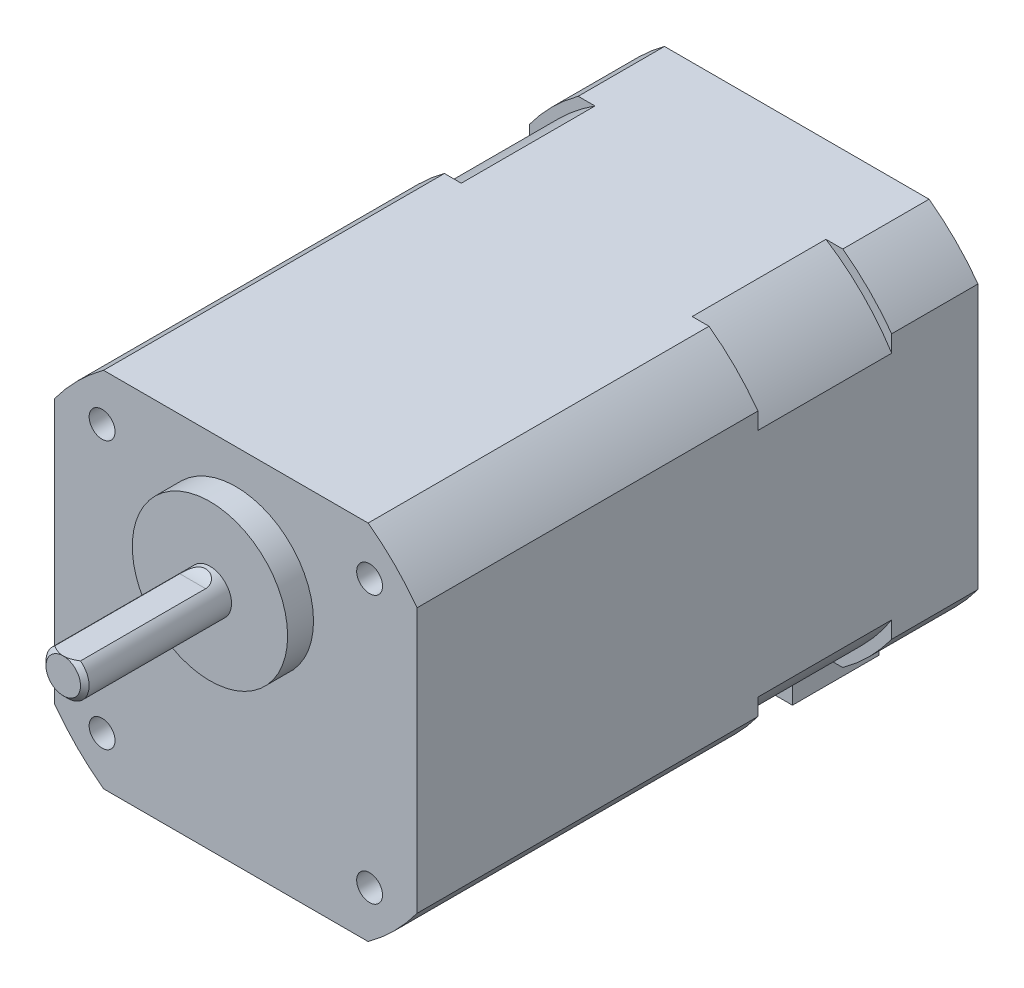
ISO-10303-21;
HEADER;
FILE_DESCRIPTION(('STEP AP214'),'2;1');
FILE_NAME('part.step','',(''),(''),'','','');
FILE_SCHEMA(('AUTOMOTIVE_DESIGN { 1 0 10303 214 1 1 1 1 }'));
ENDSEC;
DATA;
#1=APPLICATION_CONTEXT('core data for automotive mechanical design processes');
#2=APPLICATION_PROTOCOL_DEFINITION('international standard','automotive_design',2000,#1);
#3=PRODUCT_CONTEXT('',#1,'mechanical');
#4=PRODUCT('Part','Part','',(#3));
#5=PRODUCT_RELATED_PRODUCT_CATEGORY('part','',(#4));
#6=PRODUCT_DEFINITION_FORMATION('','',#4);
#7=PRODUCT_DEFINITION_CONTEXT('part definition',#1,'design');
#8=PRODUCT_DEFINITION('design','',#6,#7);
#9=PRODUCT_DEFINITION_SHAPE('','',#8);
#10=(LENGTH_UNIT() NAMED_UNIT(*) SI_UNIT(.MILLI.,.METRE.));
#11=(NAMED_UNIT(*) PLANE_ANGLE_UNIT() SI_UNIT($,.RADIAN.));
#12=(NAMED_UNIT(*) SI_UNIT($,.STERADIAN.) SOLID_ANGLE_UNIT());
#13=UNCERTAINTY_MEASURE_WITH_UNIT(LENGTH_MEASURE(1.E-05),#10,'distance_accuracy_value','');
#14=(GEOMETRIC_REPRESENTATION_CONTEXT(3) GLOBAL_UNCERTAINTY_ASSIGNED_CONTEXT((#13)) GLOBAL_UNIT_ASSIGNED_CONTEXT((#10,
#11,#12)) REPRESENTATION_CONTEXT('',''));
#15=CARTESIAN_POINT('',(0.,0.,0.));
#16=DIRECTION('',(0.,0.,1.));
#17=DIRECTION('',(1.,0.,0.));
#18=AXIS2_PLACEMENT_3D('',#15,#16,#17);
#19=CARTESIAN_POINT('',(0.,-29.,-32.2));
#20=DIRECTION('',(0.,1.,0.));
#21=DIRECTION('',(0.,0.,1.));
#22=AXIS2_PLACEMENT_3D('',#19,#20,#21);
#23=PLANE('',#22);
#24=DIRECTION('',(0.,0.,-1.));
#25=VECTOR('',#24,1.);
#26=CARTESIAN_POINT('',(-9.5,-29.,-65.));
#27=LINE('',#26,#25);
#28=CARTESIAN_POINT('',(-9.5,-29.,-55.));
#29=VERTEX_POINT('',#28);
#30=CARTESIAN_POINT('',(-9.5,-29.,-65.));
#31=VERTEX_POINT('',#30);
#32=EDGE_CURVE('E55',#29,#31,#27,.T.);
#33=ORIENTED_EDGE('',*,*,#32,.F.);
#34=DIRECTION('',(-1.,0.,0.));
#35=VECTOR('',#34,1.);
#36=CARTESIAN_POINT('',(-9.5,-29.,-55.));
#37=LINE('',#36,#35);
#38=CARTESIAN_POINT('',(9.5,-29.,-55.));
#39=VERTEX_POINT('',#38);
#40=EDGE_CURVE('E257',#39,#29,#37,.T.);
#41=ORIENTED_EDGE('',*,*,#40,.F.);
#42=DIRECTION('',(0.,0.,1.));
#43=VECTOR('',#42,1.);
#44=CARTESIAN_POINT('',(9.5,-29.,-65.));
#45=LINE('',#44,#43);
#46=CARTESIAN_POINT('',(9.5,-29.,-65.));
#47=VERTEX_POINT('',#46);
#48=EDGE_CURVE('E1106',#47,#39,#45,.T.);
#49=ORIENTED_EDGE('',*,*,#48,.F.);
#50=DIRECTION('',(-1.,0.,0.));
#51=VECTOR('',#50,1.);
#52=CARTESIAN_POINT('',(0.,-29.,-65.));
#53=LINE('',#52,#51);
#54=CARTESIAN_POINT('',(15.3297097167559,-29.,-65.));
#55=VERTEX_POINT('',#54);
#56=EDGE_CURVE('E268',#55,#47,#53,.T.);
#57=ORIENTED_EDGE('',*,*,#56,.F.);
#58=DIRECTION('',(0.,0.,1.));
#59=VECTOR('',#58,1.);
#60=CARTESIAN_POINT('',(15.3297097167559,-29.,-65.));
#61=LINE('',#60,#59);
#62=CARTESIAN_POINT('',(15.3297097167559,-29.,-55.));
#63=VERTEX_POINT('',#62);
#64=EDGE_CURVE('E283',#55,#63,#61,.T.);
#65=ORIENTED_EDGE('',*,*,#64,.T.);
#66=DIRECTION('',(-1.,0.,0.));
#67=VECTOR('',#66,1.);
#68=CARTESIAN_POINT('',(0.,-29.,-55.));
#69=LINE('',#68,#67);
#70=CARTESIAN_POINT('',(13.3794618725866,-29.,-55.));
#71=VERTEX_POINT('',#70);
#72=EDGE_CURVE('E262',#63,#71,#69,.T.);
#73=ORIENTED_EDGE('',*,*,#72,.T.);
#74=DIRECTION('',(0.,0.,1.));
#75=VECTOR('',#74,1.);
#76=CARTESIAN_POINT('',(13.3794618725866,-29.,-55.));
#77=LINE('',#76,#75);
#78=CARTESIAN_POINT('',(13.3794618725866,-29.,-39.5));
#79=VERTEX_POINT('',#78);
#80=EDGE_CURVE('E345',#71,#79,#77,.T.);
#81=ORIENTED_EDGE('',*,*,#80,.T.);
#82=DIRECTION('',(-1.,0.,0.));
#83=VECTOR('',#82,1.);
#84=CARTESIAN_POINT('',(15.3297097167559,-29.,-39.5));
#85=LINE('',#84,#83);
#86=CARTESIAN_POINT('',(15.3297097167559,-29.,-39.5));
#87=VERTEX_POINT('',#86);
#88=EDGE_CURVE('E385',#87,#79,#85,.T.);
#89=ORIENTED_EDGE('',*,*,#88,.F.);
#90=DIRECTION('',(0.,0.,1.));
#91=VECTOR('',#90,1.);
#92=CARTESIAN_POINT('',(15.3297097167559,-29.,-32.2));
#93=LINE('',#92,#91);
#94=CARTESIAN_POINT('',(15.3297097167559,-29.,0.));
#95=VERTEX_POINT('',#94);
#96=EDGE_CURVE('E410',#87,#95,#93,.T.);
#97=ORIENTED_EDGE('',*,*,#96,.T.);
#98=DIRECTION('',(-1.,0.,0.));
#99=VECTOR('',#98,1.);
#100=CARTESIAN_POINT('',(0.,-29.,0.));
#101=LINE('',#100,#99);
#102=CARTESIAN_POINT('',(-15.3297097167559,-29.,0.));
#103=VERTEX_POINT('',#102);
#104=EDGE_CURVE('E402',#95,#103,#101,.T.);
#105=ORIENTED_EDGE('',*,*,#104,.T.);
#106=DIRECTION('',(0.,0.,1.));
#107=VECTOR('',#106,1.);
#108=CARTESIAN_POINT('',(-15.3297097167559,-29.,-32.2));
#109=LINE('',#108,#107);
#110=CARTESIAN_POINT('',(-15.3297097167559,-29.,-39.5));
#111=VERTEX_POINT('',#110);
#112=EDGE_CURVE('E407',#111,#103,#109,.T.);
#113=ORIENTED_EDGE('',*,*,#112,.F.);
#114=CARTESIAN_POINT('',(-13.3794618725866,-29.,-39.5));
#115=VERTEX_POINT('',#114);
#116=EDGE_CURVE('E384',#115,#111,#85,.T.);
#117=ORIENTED_EDGE('',*,*,#116,.F.);
#118=DIRECTION('',(0.,0.,1.));
#119=VECTOR('',#118,1.);
#120=CARTESIAN_POINT('',(-13.3794618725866,-29.,-55.));
#121=LINE('',#120,#119);
#122=CARTESIAN_POINT('',(-13.3794618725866,-29.,-55.));
#123=VERTEX_POINT('',#122);
#124=EDGE_CURVE('E342',#123,#115,#121,.T.);
#125=ORIENTED_EDGE('',*,*,#124,.F.);
#126=CARTESIAN_POINT('',(-15.3297097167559,-29.,-55.));
#127=VERTEX_POINT('',#126);
#128=EDGE_CURVE('E260',#123,#127,#69,.T.);
#129=ORIENTED_EDGE('',*,*,#128,.T.);
#130=DIRECTION('',(0.,0.,1.));
#131=VECTOR('',#130,1.);
#132=CARTESIAN_POINT('',(-15.3297097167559,-29.,-65.));
#133=LINE('',#132,#131);
#134=CARTESIAN_POINT('',(-15.3297097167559,-29.,-65.));
#135=VERTEX_POINT('',#134);
#136=EDGE_CURVE('E326',#135,#127,#133,.T.);
#137=ORIENTED_EDGE('',*,*,#136,.F.);
#138=EDGE_CURVE('E60',#31,#135,#53,.T.);
#139=ORIENTED_EDGE('',*,*,#138,.F.);
#140=EDGE_LOOP('',(#33,#41,#49,#57,#65,#73,#81,#89,#97,#105,#113,#117,#125,#129,#137,#139));
#141=FACE_BOUND('',#140,.T.);
#142=ADVANCED_FACE('F39',(#141),#23,.F.);
#143=CARTESIAN_POINT('',(0.,-8.,-39.5));
#144=DIRECTION('',(0.,0.,-1.));
#145=DIRECTION('',(-1.,0.,0.));
#146=AXIS2_PLACEMENT_3D('',#143,#144,#145);
#147=PLANE('',#146);
#148=CARTESIAN_POINT('',(0.,-8.,-39.5));
#149=DIRECTION('',(0.,0.,-1.));
#150=DIRECTION('',(-1.,0.,0.));
#151=AXIS2_PLACEMENT_3D('',#148,#149,#150);
#152=CIRCLE('',#151,24.9);
#153=CARTESIAN_POINT('',(-21.,-21.3794618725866,-39.5));
#154=VERTEX_POINT('',#153);
#155=EDGE_CURVE('E334',#115,#154,#152,.T.);
#156=ORIENTED_EDGE('',*,*,#155,.F.);
#157=ORIENTED_EDGE('',*,*,#116,.T.);
#158=CARTESIAN_POINT('',(0.,-8.,-39.5));
#159=DIRECTION('',(0.,0.,-1.));
#160=DIRECTION('',(-1.,0.,0.));
#161=AXIS2_PLACEMENT_3D('',#158,#159,#160);
#162=CIRCLE('',#161,26.);
#163=CARTESIAN_POINT('',(-21.,-23.3297097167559,-39.5));
#164=VERTEX_POINT('',#163);
#165=EDGE_CURVE('E363',#111,#164,#162,.T.);
#166=ORIENTED_EDGE('',*,*,#165,.T.);
#167=DIRECTION('',(0.,1.,0.));
#168=VECTOR('',#167,1.);
#169=CARTESIAN_POINT('',(-21.,-23.3297097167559,-39.5));
#170=LINE('',#169,#168);
#171=EDGE_CURVE('E367',#164,#154,#170,.T.);
#172=ORIENTED_EDGE('',*,*,#171,.T.);
#173=EDGE_LOOP('',(#156,#157,#166,#172));
#174=FACE_BOUND('',#173,.T.);
#175=ADVANCED_FACE('F604',(#174),#147,.T.);
#176=CARTESIAN_POINT('',(21.,-21.3794618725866,-39.5));
#177=VERTEX_POINT('',#176);
#178=EDGE_CURVE('E546',#177,#79,#152,.T.);
#179=ORIENTED_EDGE('',*,*,#178,.F.);
#180=DIRECTION('',(0.,-1.,0.));
#181=VECTOR('',#180,1.);
#182=CARTESIAN_POINT('',(21.,7.3297097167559,-39.5));
#183=LINE('',#182,#181);
#184=CARTESIAN_POINT('',(21.,-23.3297097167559,-39.5));
#185=VERTEX_POINT('',#184);
#186=EDGE_CURVE('E378',#177,#185,#183,.T.);
#187=ORIENTED_EDGE('',*,*,#186,.T.);
#188=CARTESIAN_POINT('',(0.,-8.,-39.5));
#189=DIRECTION('',(0.,0.,-1.));
#190=DIRECTION('',(-1.,0.,0.));
#191=AXIS2_PLACEMENT_3D('',#188,#189,#190);
#192=CIRCLE('',#191,26.);
#193=EDGE_CURVE('E381',#185,#87,#192,.T.);
#194=ORIENTED_EDGE('',*,*,#193,.T.);
#195=ORIENTED_EDGE('',*,*,#88,.T.);
#196=EDGE_LOOP('',(#179,#187,#194,#195));
#197=FACE_BOUND('',#196,.T.);
#198=ADVANCED_FACE('F606',(#197),#147,.T.);
#199=CARTESIAN_POINT('',(13.3794618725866,13.,-39.5));
#200=VERTEX_POINT('',#199);
#201=CARTESIAN_POINT('',(21.,5.37946187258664,-39.5));
#202=VERTEX_POINT('',#201);
#203=EDGE_CURVE('E338',#200,#202,#152,.T.);
#204=ORIENTED_EDGE('',*,*,#203,.F.);
#205=DIRECTION('',(1.,0.,0.));
#206=VECTOR('',#205,1.);
#207=CARTESIAN_POINT('',(-15.3297097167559,13.,-39.5));
#208=LINE('',#207,#206);
#209=CARTESIAN_POINT('',(15.3297097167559,13.,-39.5));
#210=VERTEX_POINT('',#209);
#211=EDGE_CURVE('E372',#200,#210,#208,.T.);
#212=ORIENTED_EDGE('',*,*,#211,.T.);
#213=CARTESIAN_POINT('',(0.,-8.,-39.5));
#214=DIRECTION('',(0.,0.,-1.));
#215=DIRECTION('',(-1.,0.,0.));
#216=AXIS2_PLACEMENT_3D('',#213,#214,#215);
#217=CIRCLE('',#216,26.);
#218=CARTESIAN_POINT('',(21.,7.3297097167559,-39.5));
#219=VERTEX_POINT('',#218);
#220=EDGE_CURVE('E375',#210,#219,#217,.T.);
#221=ORIENTED_EDGE('',*,*,#220,.T.);
#222=EDGE_CURVE('E379',#219,#202,#183,.T.);
#223=ORIENTED_EDGE('',*,*,#222,.T.);
#224=EDGE_LOOP('',(#204,#212,#221,#223));
#225=FACE_BOUND('',#224,.T.);
#226=ADVANCED_FACE('F502',(#225),#147,.T.);
#227=CARTESIAN_POINT('',(0.,0.,3.));
#228=DIRECTION('',(0.,0.,-1.));
#229=DIRECTION('',(-1.,0.,0.));
#230=AXIS2_PLACEMENT_3D('',#227,#228,#229);
#231=CYLINDRICAL_SURFACE('',#230,9.);
#232=CARTESIAN_POINT('',(0.,0.,3.));
#233=DIRECTION('',(0.,0.,1.));
#234=DIRECTION('',(1.,0.,0.));
#235=AXIS2_PLACEMENT_3D('',#232,#233,#234);
#236=CIRCLE('',#235,9.);
#237=CARTESIAN_POINT('',(9.,0.,3.));
#238=VERTEX_POINT('',#237);
#239=EDGE_CURVE('E433',#238,#238,#236,.T.);
#240=ORIENTED_EDGE('',*,*,#239,.F.);
#241=EDGE_LOOP('',(#240));
#242=FACE_BOUND('',#241,.T.);
#243=CARTESIAN_POINT('',(0.,0.,0.));
#244=DIRECTION('',(0.,0.,1.));
#245=DIRECTION('',(1.,0.,0.));
#246=AXIS2_PLACEMENT_3D('',#243,#244,#245);
#247=CIRCLE('',#246,9.);
#248=CARTESIAN_POINT('',(9.,0.,0.));
#249=VERTEX_POINT('',#248);
#250=EDGE_CURVE('E424',#249,#249,#247,.T.);
#251=ORIENTED_EDGE('',*,*,#250,.T.);
#252=EDGE_LOOP('',(#251));
#253=FACE_BOUND('',#252,.T.);
#254=ADVANCED_FACE('F497',(#242,#253),#231,.T.);
#255=CARTESIAN_POINT('',(0.,0.,3.));
#256=DIRECTION('',(0.,0.,1.));
#257=DIRECTION('',(1.,0.,0.));
#258=AXIS2_PLACEMENT_3D('',#255,#256,#257);
#259=PLANE('',#258);
#260=CARTESIAN_POINT('',(0.,0.,3.));
#261=DIRECTION('',(0.,0.,1.));
#262=DIRECTION('',(1.,0.,0.));
#263=AXIS2_PLACEMENT_3D('',#260,#261,#262);
#264=CIRCLE('',#263,2.5);
#265=CARTESIAN_POINT('',(2.5,0.,3.));
#266=VERTEX_POINT('',#265);
#267=EDGE_CURVE('E434',#266,#266,#264,.T.);
#268=ORIENTED_EDGE('',*,*,#267,.F.);
#269=EDGE_LOOP('',(#268));
#270=FACE_BOUND('',#269,.T.);
#271=ORIENTED_EDGE('',*,*,#239,.T.);
#272=EDGE_LOOP('',(#271));
#273=FACE_BOUND('',#272,.T.);
#274=ADVANCED_FACE('F492',(#270,#273),#259,.T.);
#275=CARTESIAN_POINT('',(0.,0.,20.));
#276=DIRECTION('',(0.,0.,-1.));
#277=DIRECTION('',(-1.,0.,0.));
#278=AXIS2_PLACEMENT_3D('',#275,#276,#277);
#279=CYLINDRICAL_SURFACE('',#278,2.5);
#280=DIRECTION('',(0.,0.,-1.));
#281=VECTOR('',#280,1.);
#282=CARTESIAN_POINT('',(1.5,2.,20.));
#283=LINE('',#282,#281);
#284=CARTESIAN_POINT('',(1.5,2.,5.));
#285=VERTEX_POINT('',#284);
#286=CARTESIAN_POINT('',(1.5,2.,19.5));
#287=VERTEX_POINT('',#286);
#288=EDGE_CURVE('E428',#285,#287,#283,.F.);
#289=ORIENTED_EDGE('',*,*,#288,.T.);
#290=CARTESIAN_POINT('',(0.,0.,19.5));
#291=DIRECTION('',(0.,0.,1.));
#292=DIRECTION('',(1.,0.,0.));
#293=AXIS2_PLACEMENT_3D('',#290,#291,#292);
#294=CIRCLE('',#293,2.5);
#295=CARTESIAN_POINT('',(-1.5,2.,19.5));
#296=VERTEX_POINT('',#295);
#297=EDGE_CURVE('E11',#287,#296,#294,.F.);
#298=ORIENTED_EDGE('',*,*,#297,.T.);
#299=DIRECTION('',(0.,0.,-1.));
#300=VECTOR('',#299,1.);
#301=CARTESIAN_POINT('',(-1.5,2.,20.));
#302=LINE('',#301,#300);
#303=CARTESIAN_POINT('',(-1.5,2.,5.));
#304=VERTEX_POINT('',#303);
#305=EDGE_CURVE('E431',#296,#304,#302,.T.);
#306=ORIENTED_EDGE('',*,*,#305,.T.);
#307=CARTESIAN_POINT('',(-1.5,2.,5.));
#308=CARTESIAN_POINT('',(-1.49999715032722,1.99999314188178,4.95892674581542));
#309=CARTESIAN_POINT('',(-1.49865021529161,2.0010120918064,4.91785429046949));
#310=CARTESIAN_POINT('',(-1.4932483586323,2.00505117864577,4.83598328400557));
#311=CARTESIAN_POINT('',(-1.48919319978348,2.00807149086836,4.79518475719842));
#312=CARTESIAN_POINT('',(-1.47835056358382,2.01606618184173,4.71410748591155));
#313=CARTESIAN_POINT('',(-1.47156081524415,2.02104218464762,4.67382920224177));
#314=CARTESIAN_POINT('',(-1.45522246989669,2.03283738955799,4.59412385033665));
#315=CARTESIAN_POINT('',(-1.44567398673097,2.03965651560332,4.55469674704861));
#316=CARTESIAN_POINT('',(-1.41279633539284,2.06270144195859,4.43800575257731));
#317=CARTESIAN_POINT('',(-1.38523998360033,2.08151079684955,4.36237086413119));
#318=CARTESIAN_POINT('',(-1.31873332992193,2.12426241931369,4.21798498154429));
#319=CARTESIAN_POINT('',(-1.2797940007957,2.14819973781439,4.14922744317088));
#320=CARTESIAN_POINT('',(-1.19150122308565,2.19837375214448,4.02166810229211));
#321=CARTESIAN_POINT('',(-1.14234473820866,2.2245621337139,3.96271134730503));
#322=CARTESIAN_POINT('',(-1.0340484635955,2.27691680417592,3.85478819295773));
#323=CARTESIAN_POINT('',(-0.974907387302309,2.30308308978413,3.80582308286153));
#324=CARTESIAN_POINT('',(-0.849770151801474,2.35208125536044,3.71982766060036));
#325=CARTESIAN_POINT('',(-0.783987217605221,2.37498114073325,3.68252488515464));
#326=CARTESIAN_POINT('',(-0.646171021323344,2.41611971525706,3.61837007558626));
#327=CARTESIAN_POINT('',(-0.574136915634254,2.43435777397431,3.59151945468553));
#328=CARTESIAN_POINT('',(-0.424128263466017,2.46497580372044,3.54761782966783));
#329=CARTESIAN_POINT('',(-0.346056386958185,2.47721439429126,3.5308014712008));
#330=CARTESIAN_POINT('',(-0.187572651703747,2.49422805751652,3.50765769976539));
#331=CARTESIAN_POINT('',(-0.107160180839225,2.49900115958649,3.50133305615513));
#332=CARTESIAN_POINT('',(0.0569228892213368,2.50074733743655,3.49900227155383));
#333=CARTESIAN_POINT('',(0.140602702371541,2.4974215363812,3.50339152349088));
#334=CARTESIAN_POINT('',(0.305874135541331,2.48260441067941,3.5234269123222));
#335=CARTESIAN_POINT('',(0.387465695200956,2.47111285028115,3.539073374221));
#336=CARTESIAN_POINT('',(0.546475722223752,2.44088811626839,3.58199212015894));
#337=CARTESIAN_POINT('',(0.623877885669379,2.42212868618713,3.60930659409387));
#338=CARTESIAN_POINT('',(0.771757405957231,2.37914220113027,3.67579490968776));
#339=CARTESIAN_POINT('',(0.842236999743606,2.35491692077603,3.71496490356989));
#340=CARTESIAN_POINT('',(0.971781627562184,2.3044115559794,3.8033874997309));
#341=CARTESIAN_POINT('',(1.03115970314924,2.27823299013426,3.8522394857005));
#342=CARTESIAN_POINT('',(1.13991312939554,2.2258143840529,3.95997396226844));
#343=CARTESIAN_POINT('',(1.18929246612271,2.1995743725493,4.01885243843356));
#344=CARTESIAN_POINT('',(1.2760399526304,2.15038394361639,4.14345454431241));
#345=CARTESIAN_POINT('',(1.31369451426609,2.12736421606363,4.20895245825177));
#346=CARTESIAN_POINT('',(1.37859452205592,2.08589814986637,4.34635283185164));
#347=CARTESIAN_POINT('',(1.4058302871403,2.06745607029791,4.41826117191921));
#348=CARTESIAN_POINT('',(1.43999574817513,2.0436789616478,4.5328616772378));
#349=CARTESIAN_POINT('',(1.45054113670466,2.03618591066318,4.57408272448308));
#350=CARTESIAN_POINT('',(1.46858445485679,2.023211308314,4.65751363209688));
#351=CARTESIAN_POINT('',(1.4760819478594,2.01773004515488,4.6997236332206));
#352=CARTESIAN_POINT('',(1.48806028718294,2.00891381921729,4.7847875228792));
#353=CARTESIAN_POINT('',(1.49254110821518,2.00557887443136,4.82764141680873));
#354=CARTESIAN_POINT('',(1.49850899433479,2.00111793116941,4.91366338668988));
#355=CARTESIAN_POINT('',(1.4999966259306,1.99999151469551,4.95683140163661));
#356=CARTESIAN_POINT('',(1.50000000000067,1.99999999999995,4.99999999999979));
#357=B_SPLINE_CURVE_WITH_KNOTS('',3,(#307,#308,#309,#310,#311,#312,#313,#314,#315,#316,#317,
#318,#319,#320,#321,#322,#323,#324,#325,#326,#327,#328,#329,#330,#331,#332,#333,#334,#335,#336,
#337,#338,#339,#340,#341,#342,#343,#344,#345,#346,#347,#348,#349,#350,#351,#352,#353,#354,#355,
#356),.UNSPECIFIED.,.F.,.F.,(4,2,2,2,2,2,2,2,2,2,2,2,2,2,2,2,2,2,2,2,2,2,2,2,4),(0.,
0.123183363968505,0.246377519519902,0.369674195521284,0.492965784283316,0.739665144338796,
0.986127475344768,1.22821834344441,1.47034042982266,1.70628928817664,1.94227003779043,
2.18357238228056,2.42493841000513,2.67534571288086,2.92576024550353,3.17708801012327,
3.42833429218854,3.67079201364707,3.91315288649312,4.14901905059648,4.38510385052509,
4.5145729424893,4.64406057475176,4.77354929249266,4.9030135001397),.UNSPECIFIED.);
#358=EDGE_CURVE('E437',#304,#285,#357,.T.);
#359=ORIENTED_EDGE('',*,*,#358,.T.);
#360=EDGE_LOOP('',(#289,#298,#306,#359));
#361=FACE_BOUND('',#360,.T.);
#362=ORIENTED_EDGE('',*,*,#267,.T.);
#363=EDGE_LOOP('',(#362));
#364=FACE_BOUND('',#363,.T.);
#365=ADVANCED_FACE('F452',(#361,#364),#279,.T.);
#366=CARTESIAN_POINT('',(0.,0.,20.));
#367=DIRECTION('',(0.,0.,1.));
#368=DIRECTION('',(1.,0.,0.));
#369=AXIS2_PLACEMENT_3D('',#366,#367,#368);
#370=PLANE('',#369);
#371=CARTESIAN_POINT('',(0.,0.,20.));
#372=DIRECTION('',(0.,0.,1.));
#373=DIRECTION('',(1.,0.,0.));
#374=AXIS2_PLACEMENT_3D('',#371,#372,#373);
#375=CIRCLE('',#374,1.99999999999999);
#376=CARTESIAN_POINT('',(0.,2.,20.));
#377=VERTEX_POINT('',#376);
#378=EDGE_CURVE('E450',#377,#377,#375,.T.);
#379=ORIENTED_EDGE('',*,*,#378,.T.);
#380=EDGE_LOOP('',(#379));
#381=FACE_BOUND('',#380,.T.);
#382=ADVANCED_FACE('F462',(#381),#370,.T.);
#383=CARTESIAN_POINT('',(-2.5,4.5,5.));
#384=DIRECTION('',(1.,0.,0.));
#385=DIRECTION('',(0.,0.,-1.));
#386=AXIS2_PLACEMENT_3D('',#383,#384,#385);
#387=CYLINDRICAL_SURFACE('',#386,2.5);
#388=DIRECTION('',(1.,0.,0.));
#389=VECTOR('',#388,1.);
#390=CARTESIAN_POINT('',(-2.5,2.,5.));
#391=LINE('',#390,#389);
#392=EDGE_CURVE('E425',#304,#285,#391,.T.);
#393=ORIENTED_EDGE('',*,*,#392,.T.);
#394=ORIENTED_EDGE('',*,*,#358,.F.);
#395=EDGE_LOOP('',(#393,#394));
#396=FACE_BOUND('',#395,.T.);
#397=ADVANCED_FACE('F456',(#396),#387,.F.);
#398=CARTESIAN_POINT('',(-2.5,2.,0.));
#399=DIRECTION('',(0.,-1.,0.));
#400=DIRECTION('',(0.,0.,-1.));
#401=AXIS2_PLACEMENT_3D('',#398,#399,#400);
#402=PLANE('',#401);
#403=CARTESIAN_POINT('',(-1.5,2.,19.5));
#404=CARTESIAN_POINT('',(-1.42763018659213,2.,19.5433736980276));
#405=CARTESIAN_POINT('',(-1.35436226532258,2.,19.5853687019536));
#406=CARTESIAN_POINT('',(-1.20549660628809,2.,19.6656443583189));
#407=CARTESIAN_POINT('',(-1.12989157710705,2.,19.7039114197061));
#408=CARTESIAN_POINT('',(-0.978296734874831,2.,19.774534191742));
#409=CARTESIAN_POINT('',(-0.902366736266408,2.,19.8070165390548));
#410=CARTESIAN_POINT('',(-0.748220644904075,2.,19.8658090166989));
#411=CARTESIAN_POINT('',(-0.670007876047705,2.,19.8921276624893));
#412=CARTESIAN_POINT('',(-0.543060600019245,2.,19.9280861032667));
#413=CARTESIAN_POINT('',(-0.495021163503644,2.,19.9401901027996));
#414=CARTESIAN_POINT('',(-0.398260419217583,2.,19.9612794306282));
#415=CARTESIAN_POINT('',(-0.349539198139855,2.,19.9702651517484));
#416=CARTESIAN_POINT('',(-0.250852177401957,2.,19.984927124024));
#417=CARTESIAN_POINT('',(-0.200878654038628,2.,19.9905520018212));
#418=CARTESIAN_POINT('',(-0.100607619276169,2.,19.9981023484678));
#419=CARTESIAN_POINT('',(-0.0503098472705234,2.,20.0000243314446));
#420=CARTESIAN_POINT('',(0.,2.,20.));
#421=B_SPLINE_CURVE_WITH_KNOTS('',3,(#403,#404,#405,#406,#407,#408,#409,#410,#411,#412,#413,
#414,#415,#416,#417,#418,#419,#420),.UNSPECIFIED.,.F.,.F.,(4,2,2,2,2,2,2,2,4),(0.,
0.253195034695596,0.507281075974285,0.754837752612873,1.00205037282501,1.15058504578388,
1.29910100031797,1.44983263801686,1.600706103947),.UNSPECIFIED.);
#422=EDGE_CURVE('E470',#296,#377,#421,.T.);
#423=ORIENTED_EDGE('',*,*,#422,.T.);
#424=CARTESIAN_POINT('',(0.,1.99999999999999,20.));
#425=CARTESIAN_POINT('',(0.0614966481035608,2.,20.0000514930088));
#426=CARTESIAN_POINT('',(0.122961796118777,2.,19.997164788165));
#427=CARTESIAN_POINT('',(0.245274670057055,2.,19.9859212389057));
#428=CARTESIAN_POINT('',(0.306123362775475,2.,19.9775750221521));
#429=CARTESIAN_POINT('',(0.425885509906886,2.,19.9559969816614));
#430=CARTESIAN_POINT('',(0.484814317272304,2.,19.9428488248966));
#431=CARTESIAN_POINT('',(0.601555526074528,2.,19.9122507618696));
#432=CARTESIAN_POINT('',(0.659367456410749,2.,19.8947990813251));
#433=CARTESIAN_POINT('',(0.784576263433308,2.,19.8525702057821));
#434=CARTESIAN_POINT('',(0.851714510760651,2.,19.8270315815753));
#435=CARTESIAN_POINT('',(0.984250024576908,2.,19.7717452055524));
#436=CARTESIAN_POINT('',(1.04964642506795,2.,19.7419954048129));
#437=CARTESIAN_POINT('',(1.18016546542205,2.,19.6784785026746));
#438=CARTESIAN_POINT('',(1.24525271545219,2.,19.6446394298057));
#439=CARTESIAN_POINT('',(1.37378197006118,2.,19.5742160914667));
#440=CARTESIAN_POINT('',(1.43722666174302,2.,19.5376367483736));
#441=CARTESIAN_POINT('',(1.5,2.,19.5));
#442=B_SPLINE_CURVE_WITH_KNOTS('',3,(#424,#425,#426,#427,#428,#429,#430,#431,#432,#433,#434,
#435,#436,#437,#438,#439,#440,#441),.UNSPECIFIED.,.F.,.F.,(4,2,2,2,2,2,2,2,4),(0.,
0.184371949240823,0.368386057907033,0.549336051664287,0.730360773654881,0.945674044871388,
1.16109243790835,1.38109142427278,1.60070428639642),.UNSPECIFIED.);
#443=EDGE_CURVE('E48',#377,#287,#442,.T.);
#444=ORIENTED_EDGE('',*,*,#443,.T.);
#445=ORIENTED_EDGE('',*,*,#288,.F.);
#446=ORIENTED_EDGE('',*,*,#392,.F.);
#447=ORIENTED_EDGE('',*,*,#305,.F.);
#448=EDGE_LOOP('',(#423,#444,#445,#446,#447));
#449=FACE_BOUND('',#448,.T.);
#450=ADVANCED_FACE('F461',(#449),#402,.F.);
#451=CARTESIAN_POINT('',(0.,0.,20.));
#452=DIRECTION('',(0.,0.,-1.));
#453=DIRECTION('',(-1.,0.,0.));
#454=AXIS2_PLACEMENT_3D('',#451,#452,#453);
#455=CONICAL_SURFACE('',#454,1.99999999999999,0.785398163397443);
#456=ORIENTED_EDGE('',*,*,#422,.F.);
#457=ORIENTED_EDGE('',*,*,#297,.F.);
#458=ORIENTED_EDGE('',*,*,#443,.F.);
#459=ORIENTED_EDGE('',*,*,#378,.F.);
#460=EDGE_LOOP('',(#456,#457,#458,#459));
#461=FACE_BOUND('',#460,.T.);
#462=ADVANCED_FACE('F41',(#461),#455,.T.);
#463=CARTESIAN_POINT('',(-21.,0.,-32.2));
#464=DIRECTION('',(1.,0.,0.));
#465=DIRECTION('',(0.,0.,-1.));
#466=AXIS2_PLACEMENT_3D('',#463,#464,#465);
#467=PLANE('',#466);
#468=DIRECTION('',(0.,1.,0.));
#469=VECTOR('',#468,1.);
#470=CARTESIAN_POINT('',(-21.,0.,0.));
#471=LINE('',#470,#469);
#472=CARTESIAN_POINT('',(-21.,-23.3297097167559,0.));
#473=VERTEX_POINT('',#472);
#474=CARTESIAN_POINT('',(-21.,7.3297097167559,0.));
#475=VERTEX_POINT('',#474);
#476=EDGE_CURVE('E387',#473,#475,#471,.T.);
#477=ORIENTED_EDGE('',*,*,#476,.T.);
#478=DIRECTION('',(0.,0.,1.));
#479=VECTOR('',#478,1.);
#480=CARTESIAN_POINT('',(-21.,7.3297097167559,-32.2));
#481=LINE('',#480,#479);
#482=CARTESIAN_POINT('',(-21.,7.3297097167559,-39.5));
#483=VERTEX_POINT('',#482);
#484=EDGE_CURVE('E421',#483,#475,#481,.T.);
#485=ORIENTED_EDGE('',*,*,#484,.F.);
#486=CARTESIAN_POINT('',(-21.,5.37946187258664,-39.5));
#487=VERTEX_POINT('',#486);
#488=EDGE_CURVE('E366',#487,#483,#170,.T.);
#489=ORIENTED_EDGE('',*,*,#488,.F.);
#490=DIRECTION('',(0.,0.,1.));
#491=VECTOR('',#490,1.);
#492=CARTESIAN_POINT('',(-21.,5.37946187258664,-55.));
#493=LINE('',#492,#491);
#494=CARTESIAN_POINT('',(-21.,5.37946187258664,-55.));
#495=VERTEX_POINT('',#494);
#496=EDGE_CURVE('E360',#495,#487,#493,.T.);
#497=ORIENTED_EDGE('',*,*,#496,.F.);
#498=DIRECTION('',(0.,1.,0.));
#499=VECTOR('',#498,1.);
#500=CARTESIAN_POINT('',(-21.,0.,-55.));
#501=LINE('',#500,#499);
#502=CARTESIAN_POINT('',(-21.,7.3297097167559,-55.));
#503=VERTEX_POINT('',#502);
#504=EDGE_CURVE('E288',#495,#503,#501,.T.);
#505=ORIENTED_EDGE('',*,*,#504,.T.);
#506=DIRECTION('',(0.,0.,1.));
#507=VECTOR('',#506,1.);
#508=CARTESIAN_POINT('',(-21.,7.3297097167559,-65.));
#509=LINE('',#508,#507);
#510=CARTESIAN_POINT('',(-21.,7.3297097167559,-65.));
#511=VERTEX_POINT('',#510);
#512=EDGE_CURVE('E320',#511,#503,#509,.T.);
#513=ORIENTED_EDGE('',*,*,#512,.F.);
#514=DIRECTION('',(0.,1.,0.));
#515=VECTOR('',#514,1.);
#516=CARTESIAN_POINT('',(-21.,0.,-65.));
#517=LINE('',#516,#515);
#518=CARTESIAN_POINT('',(-21.,-23.3297097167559,-65.));
#519=VERTEX_POINT('',#518);
#520=EDGE_CURVE('E272',#519,#511,#517,.T.);
#521=ORIENTED_EDGE('',*,*,#520,.F.);
#522=DIRECTION('',(0.,0.,1.));
#523=VECTOR('',#522,1.);
#524=CARTESIAN_POINT('',(-21.,-23.3297097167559,-65.));
#525=LINE('',#524,#523);
#526=CARTESIAN_POINT('',(-21.,-23.3297097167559,-55.));
#527=VERTEX_POINT('',#526);
#528=EDGE_CURVE('E323',#519,#527,#525,.T.);
#529=ORIENTED_EDGE('',*,*,#528,.T.);
#530=CARTESIAN_POINT('',(-21.,-21.3794618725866,-55.));
#531=VERTEX_POINT('',#530);
#532=EDGE_CURVE('E289',#527,#531,#501,.T.);
#533=ORIENTED_EDGE('',*,*,#532,.T.);
#534=DIRECTION('',(0.,0.,1.));
#535=VECTOR('',#534,1.);
#536=CARTESIAN_POINT('',(-21.,-21.3794618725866,-55.));
#537=LINE('',#536,#535);
#538=EDGE_CURVE('E339',#531,#154,#537,.T.);
#539=ORIENTED_EDGE('',*,*,#538,.T.);
#540=ORIENTED_EDGE('',*,*,#171,.F.);
#541=DIRECTION('',(0.,0.,1.));
#542=VECTOR('',#541,1.);
#543=CARTESIAN_POINT('',(-21.,-23.3297097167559,-32.2));
#544=LINE('',#543,#542);
#545=EDGE_CURVE('E404',#164,#473,#544,.T.);
#546=ORIENTED_EDGE('',*,*,#545,.T.);
#547=EDGE_LOOP('',(#477,#485,#489,#497,#505,#513,#521,#529,#533,#539,#540,#546));
#548=FACE_BOUND('',#547,.T.);
#549=ADVANCED_FACE('F464',(#548),#467,.F.);
#550=CARTESIAN_POINT('',(0.,-8.,-32.2));
#551=DIRECTION('',(0.,0.,1.));
#552=DIRECTION('',(1.,0.,0.));
#553=AXIS2_PLACEMENT_3D('',#550,#551,#552);
#554=CYLINDRICAL_SURFACE('',#553,26.);
#555=CARTESIAN_POINT('',(0.,-8.,0.));
#556=DIRECTION('',(0.,0.,-1.));
#557=DIRECTION('',(-1.,0.,0.));
#558=AXIS2_PLACEMENT_3D('',#555,#556,#557);
#559=CIRCLE('',#558,26.);
#560=CARTESIAN_POINT('',(-15.3297097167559,13.,0.));
#561=VERTEX_POINT('',#560);
#562=EDGE_CURVE('E390',#475,#561,#559,.T.);
#563=ORIENTED_EDGE('',*,*,#562,.T.);
#564=DIRECTION('',(0.,0.,1.));
#565=VECTOR('',#564,1.);
#566=CARTESIAN_POINT('',(-15.3297097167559,13.,-32.2));
#567=LINE('',#566,#565);
#568=CARTESIAN_POINT('',(-15.3297097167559,13.,-39.5));
#569=VERTEX_POINT('',#568);
#570=EDGE_CURVE('E419',#569,#561,#567,.T.);
#571=ORIENTED_EDGE('',*,*,#570,.F.);
#572=CARTESIAN_POINT('',(0.,-8.,-39.5));
#573=DIRECTION('',(0.,0.,-1.));
#574=DIRECTION('',(-1.,0.,0.));
#575=AXIS2_PLACEMENT_3D('',#572,#573,#574);
#576=CIRCLE('',#575,26.);
#577=EDGE_CURVE('E369',#483,#569,#576,.T.);
#578=ORIENTED_EDGE('',*,*,#577,.F.);
#579=ORIENTED_EDGE('',*,*,#484,.T.);
#580=EDGE_LOOP('',(#563,#571,#578,#579));
#581=FACE_BOUND('',#580,.T.);
#582=ADVANCED_FACE('F586',(#581),#554,.T.);
#583=CARTESIAN_POINT('',(0.,13.,-32.2));
#584=DIRECTION('',(0.,1.,0.));
#585=DIRECTION('',(0.,0.,1.));
#586=AXIS2_PLACEMENT_3D('',#583,#584,#585);
#587=PLANE('',#586);
#588=DIRECTION('',(-1.,0.,0.));
#589=VECTOR('',#588,1.);
#590=CARTESIAN_POINT('',(0.,13.,0.));
#591=LINE('',#590,#589);
#592=CARTESIAN_POINT('',(15.3297097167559,13.,0.));
#593=VERTEX_POINT('',#592);
#594=EDGE_CURVE('E393',#593,#561,#591,.T.);
#595=ORIENTED_EDGE('',*,*,#594,.F.);
#596=DIRECTION('',(0.,0.,1.));
#597=VECTOR('',#596,1.);
#598=CARTESIAN_POINT('',(15.3297097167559,13.,-32.2));
#599=LINE('',#598,#597);
#600=EDGE_CURVE('E417',#210,#593,#599,.T.);
#601=ORIENTED_EDGE('',*,*,#600,.F.);
#602=ORIENTED_EDGE('',*,*,#211,.F.);
#603=DIRECTION('',(0.,0.,1.));
#604=VECTOR('',#603,1.);
#605=CARTESIAN_POINT('',(13.3794618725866,13.,-55.));
#606=LINE('',#605,#604);
#607=CARTESIAN_POINT('',(13.3794618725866,13.,-55.));
#608=VERTEX_POINT('',#607);
#609=EDGE_CURVE('E354',#608,#200,#606,.T.);
#610=ORIENTED_EDGE('',*,*,#609,.F.);
#611=DIRECTION('',(1.,0.,0.));
#612=VECTOR('',#611,1.);
#613=CARTESIAN_POINT('',(0.,13.,-55.));
#614=LINE('',#613,#612);
#615=CARTESIAN_POINT('',(15.3297097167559,13.,-55.));
#616=VERTEX_POINT('',#615);
#617=EDGE_CURVE('E294',#608,#616,#614,.T.);
#618=ORIENTED_EDGE('',*,*,#617,.T.);
#619=DIRECTION('',(0.,0.,1.));
#620=VECTOR('',#619,1.);
#621=CARTESIAN_POINT('',(15.3297097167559,13.,-65.));
#622=LINE('',#621,#620);
#623=CARTESIAN_POINT('',(15.3297097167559,13.,-65.));
#624=VERTEX_POINT('',#623);
#625=EDGE_CURVE('E314',#624,#616,#622,.T.);
#626=ORIENTED_EDGE('',*,*,#625,.F.);
#627=DIRECTION('',(1.,0.,0.));
#628=VECTOR('',#627,1.);
#629=CARTESIAN_POINT('',(0.,13.,-65.));
#630=LINE('',#629,#628);
#631=CARTESIAN_POINT('',(-15.3297097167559,13.,-65.));
#632=VERTEX_POINT('',#631);
#633=EDGE_CURVE('E276',#632,#624,#630,.T.);
#634=ORIENTED_EDGE('',*,*,#633,.F.);
#635=DIRECTION('',(0.,0.,1.));
#636=VECTOR('',#635,1.);
#637=CARTESIAN_POINT('',(-15.3297097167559,13.,-65.));
#638=LINE('',#637,#636);
#639=CARTESIAN_POINT('',(-15.3297097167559,13.,-55.));
#640=VERTEX_POINT('',#639);
#641=EDGE_CURVE('E317',#632,#640,#638,.T.);
#642=ORIENTED_EDGE('',*,*,#641,.T.);
#643=CARTESIAN_POINT('',(-13.3794618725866,13.,-55.));
#644=VERTEX_POINT('',#643);
#645=EDGE_CURVE('E295',#640,#644,#614,.T.);
#646=ORIENTED_EDGE('',*,*,#645,.T.);
#647=DIRECTION('',(0.,0.,1.));
#648=VECTOR('',#647,1.);
#649=CARTESIAN_POINT('',(-13.3794618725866,13.,-55.));
#650=LINE('',#649,#648);
#651=CARTESIAN_POINT('',(-13.3794618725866,13.,-39.5));
#652=VERTEX_POINT('',#651);
#653=EDGE_CURVE('E357',#644,#652,#650,.T.);
#654=ORIENTED_EDGE('',*,*,#653,.T.);
#655=EDGE_CURVE('E373',#569,#652,#208,.T.);
#656=ORIENTED_EDGE('',*,*,#655,.F.);
#657=ORIENTED_EDGE('',*,*,#570,.T.);
#658=EDGE_LOOP('',(#595,#601,#602,#610,#618,#626,#634,#642,#646,#654,#656,#657));
#659=FACE_BOUND('',#658,.T.);
#660=ADVANCED_FACE('F583',(#659),#587,.T.);
#661=CARTESIAN_POINT('',(21.,7.3297097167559,0.));
#662=VERTEX_POINT('',#661);
#663=EDGE_CURVE('E395',#593,#662,#559,.T.);
#664=ORIENTED_EDGE('',*,*,#663,.T.);
#665=DIRECTION('',(0.,0.,1.));
#666=VECTOR('',#665,1.);
#667=CARTESIAN_POINT('',(21.,7.3297097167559,-32.2));
#668=LINE('',#667,#666);
#669=EDGE_CURVE('E415',#219,#662,#668,.T.);
#670=ORIENTED_EDGE('',*,*,#669,.F.);
#671=ORIENTED_EDGE('',*,*,#220,.F.);
#672=ORIENTED_EDGE('',*,*,#600,.T.);
#673=EDGE_LOOP('',(#664,#670,#671,#672));
#674=FACE_BOUND('',#673,.T.);
#675=ADVANCED_FACE('F528',(#674),#554,.T.);
#676=CARTESIAN_POINT('',(21.,0.,-32.2));
#677=DIRECTION('',(1.,0.,0.));
#678=DIRECTION('',(0.,0.,-1.));
#679=AXIS2_PLACEMENT_3D('',#676,#677,#678);
#680=PLANE('',#679);
#681=DIRECTION('',(0.,1.,0.));
#682=VECTOR('',#681,1.);
#683=CARTESIAN_POINT('',(21.,0.,0.));
#684=LINE('',#683,#682);
#685=CARTESIAN_POINT('',(21.,-23.3297097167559,0.));
#686=VERTEX_POINT('',#685);
#687=EDGE_CURVE('E398',#686,#662,#684,.T.);
#688=ORIENTED_EDGE('',*,*,#687,.F.);
#689=DIRECTION('',(0.,0.,1.));
#690=VECTOR('',#689,1.);
#691=CARTESIAN_POINT('',(21.,-23.3297097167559,-32.2));
#692=LINE('',#691,#690);
#693=EDGE_CURVE('E413',#185,#686,#692,.T.);
#694=ORIENTED_EDGE('',*,*,#693,.F.);
#695=ORIENTED_EDGE('',*,*,#186,.F.);
#696=DIRECTION('',(0.,0.,1.));
#697=VECTOR('',#696,1.);
#698=CARTESIAN_POINT('',(21.,-21.3794618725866,-55.));
#699=LINE('',#698,#697);
#700=CARTESIAN_POINT('',(21.,-21.3794618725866,-55.));
#701=VERTEX_POINT('',#700);
#702=EDGE_CURVE('E348',#701,#177,#699,.T.);
#703=ORIENTED_EDGE('',*,*,#702,.F.);
#704=DIRECTION('',(0.,-1.,0.));
#705=VECTOR('',#704,1.);
#706=CARTESIAN_POINT('',(21.,0.,-55.));
#707=LINE('',#706,#705);
#708=CARTESIAN_POINT('',(21.,-23.3297097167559,-55.));
#709=VERTEX_POINT('',#708);
#710=EDGE_CURVE('E300',#701,#709,#707,.T.);
#711=ORIENTED_EDGE('',*,*,#710,.T.);
#712=DIRECTION('',(0.,0.,1.));
#713=VECTOR('',#712,1.);
#714=CARTESIAN_POINT('',(21.,-23.3297097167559,-65.));
#715=LINE('',#714,#713);
#716=CARTESIAN_POINT('',(21.,-23.3297097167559,-65.));
#717=VERTEX_POINT('',#716);
#718=EDGE_CURVE('E308',#717,#709,#715,.T.);
#719=ORIENTED_EDGE('',*,*,#718,.F.);
#720=DIRECTION('',(0.,-1.,0.));
#721=VECTOR('',#720,1.);
#722=CARTESIAN_POINT('',(21.,0.,-65.));
#723=LINE('',#722,#721);
#724=CARTESIAN_POINT('',(21.,7.3297097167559,-65.));
#725=VERTEX_POINT('',#724);
#726=EDGE_CURVE('E280',#725,#717,#723,.T.);
#727=ORIENTED_EDGE('',*,*,#726,.F.);
#728=DIRECTION('',(0.,0.,1.));
#729=VECTOR('',#728,1.);
#730=CARTESIAN_POINT('',(21.,7.3297097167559,-65.));
#731=LINE('',#730,#729);
#732=CARTESIAN_POINT('',(21.,7.3297097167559,-55.));
#733=VERTEX_POINT('',#732);
#734=EDGE_CURVE('E311',#725,#733,#731,.T.);
#735=ORIENTED_EDGE('',*,*,#734,.T.);
#736=CARTESIAN_POINT('',(21.,5.37946187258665,-55.));
#737=VERTEX_POINT('',#736);
#738=EDGE_CURVE('E301',#733,#737,#707,.T.);
#739=ORIENTED_EDGE('',*,*,#738,.T.);
#740=DIRECTION('',(0.,0.,1.));
#741=VECTOR('',#740,1.);
#742=CARTESIAN_POINT('',(21.,5.37946187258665,-55.));
#743=LINE('',#742,#741);
#744=EDGE_CURVE('E351',#737,#202,#743,.T.);
#745=ORIENTED_EDGE('',*,*,#744,.T.);
#746=ORIENTED_EDGE('',*,*,#222,.F.);
#747=ORIENTED_EDGE('',*,*,#669,.T.);
#748=EDGE_LOOP('',(#688,#694,#695,#703,#711,#719,#727,#735,#739,#745,#746,#747));
#749=FACE_BOUND('',#748,.T.);
#750=ADVANCED_FACE('F535',(#749),#680,.T.);
#751=EDGE_CURVE('E401',#686,#95,#559,.T.);
#752=ORIENTED_EDGE('',*,*,#751,.T.);
#753=ORIENTED_EDGE('',*,*,#96,.F.);
#754=ORIENTED_EDGE('',*,*,#193,.F.);
#755=ORIENTED_EDGE('',*,*,#693,.T.);
#756=EDGE_LOOP('',(#752,#753,#754,#755));
#757=FACE_BOUND('',#756,.T.);
#758=ADVANCED_FACE('F648',(#757),#554,.T.);
#759=EDGE_CURVE('E394',#103,#473,#559,.T.);
#760=ORIENTED_EDGE('',*,*,#759,.T.);
#761=ORIENTED_EDGE('',*,*,#545,.F.);
#762=ORIENTED_EDGE('',*,*,#165,.F.);
#763=ORIENTED_EDGE('',*,*,#112,.T.);
#764=EDGE_LOOP('',(#760,#761,#762,#763));
#765=FACE_BOUND('',#764,.T.);
#766=ADVANCED_FACE('F509',(#765),#554,.T.);
#767=CARTESIAN_POINT('',(0.,0.,0.));
#768=DIRECTION('',(0.,0.,-1.));
#769=DIRECTION('',(-1.,0.,0.));
#770=AXIS2_PLACEMENT_3D('',#767,#768,#769);
#771=PLANE('',#770);
#772=CARTESIAN_POINT('',(15.5,-23.5,0.));
#773=DIRECTION('',(0.,0.,1.));
#774=DIRECTION('',(1.,0.,0.));
#775=AXIS2_PLACEMENT_3D('',#772,#773,#774);
#776=CIRCLE('',#775,1.5);
#777=CARTESIAN_POINT('',(17.,-23.5,0.));
#778=VERTEX_POINT('',#777);
#779=EDGE_CURVE('E1124',#778,#778,#776,.T.);
#780=ORIENTED_EDGE('',*,*,#779,.F.);
#781=EDGE_LOOP('',(#780));
#782=FACE_BOUND('',#781,.T.);
#783=CARTESIAN_POINT('',(-15.5,-23.5,0.));
#784=DIRECTION('',(0.,0.,1.));
#785=DIRECTION('',(1.,0.,0.));
#786=AXIS2_PLACEMENT_3D('',#783,#784,#785);
#787=CIRCLE('',#786,1.5);
#788=CARTESIAN_POINT('',(-14.,-23.5,0.));
#789=VERTEX_POINT('',#788);
#790=EDGE_CURVE('E1129',#789,#789,#787,.T.);
#791=ORIENTED_EDGE('',*,*,#790,.F.);
#792=EDGE_LOOP('',(#791));
#793=FACE_BOUND('',#792,.T.);
#794=CARTESIAN_POINT('',(-15.5,7.5,0.));
#795=DIRECTION('',(0.,0.,1.));
#796=DIRECTION('',(1.,0.,0.));
#797=AXIS2_PLACEMENT_3D('',#794,#795,#796);
#798=CIRCLE('',#797,1.5);
#799=CARTESIAN_POINT('',(-14.,7.5,0.));
#800=VERTEX_POINT('',#799);
#801=EDGE_CURVE('E1135',#800,#800,#798,.T.);
#802=ORIENTED_EDGE('',*,*,#801,.F.);
#803=EDGE_LOOP('',(#802));
#804=FACE_BOUND('',#803,.T.);
#805=CARTESIAN_POINT('',(15.5,7.5,0.));
#806=DIRECTION('',(0.,0.,1.));
#807=DIRECTION('',(1.,0.,0.));
#808=AXIS2_PLACEMENT_3D('',#805,#806,#807);
#809=CIRCLE('',#808,1.5);
#810=CARTESIAN_POINT('',(17.,7.5,0.));
#811=VERTEX_POINT('',#810);
#812=EDGE_CURVE('E1117',#811,#811,#809,.T.);
#813=ORIENTED_EDGE('',*,*,#812,.F.);
#814=EDGE_LOOP('',(#813));
#815=FACE_BOUND('',#814,.T.);
#816=ORIENTED_EDGE('',*,*,#250,.F.);
#817=EDGE_LOOP('',(#816));
#818=FACE_BOUND('',#817,.T.);
#819=ORIENTED_EDGE('',*,*,#476,.F.);
#820=ORIENTED_EDGE('',*,*,#759,.F.);
#821=ORIENTED_EDGE('',*,*,#104,.F.);
#822=ORIENTED_EDGE('',*,*,#751,.F.);
#823=ORIENTED_EDGE('',*,*,#687,.T.);
#824=ORIENTED_EDGE('',*,*,#663,.F.);
#825=ORIENTED_EDGE('',*,*,#594,.T.);
#826=ORIENTED_EDGE('',*,*,#562,.F.);
#827=EDGE_LOOP('',(#819,#820,#821,#822,#823,#824,#825,#826));
#828=FACE_BOUND('',#827,.T.);
#829=ADVANCED_FACE('F505',(#782,#793,#804,#815,#818,#828),#771,.F.);
#830=EDGE_CURVE('E329',#487,#652,#152,.T.);
#831=ORIENTED_EDGE('',*,*,#830,.F.);
#832=ORIENTED_EDGE('',*,*,#488,.T.);
#833=ORIENTED_EDGE('',*,*,#577,.T.);
#834=ORIENTED_EDGE('',*,*,#655,.T.);
#835=EDGE_LOOP('',(#831,#832,#833,#834));
#836=FACE_BOUND('',#835,.T.);
#837=ADVANCED_FACE('F508',(#836),#147,.T.);
#838=CARTESIAN_POINT('',(0.,-8.,-55.));
#839=DIRECTION('',(0.,0.,1.));
#840=DIRECTION('',(1.,0.,0.));
#841=AXIS2_PLACEMENT_3D('',#838,#839,#840);
#842=CYLINDRICAL_SURFACE('',#841,24.9);
#843=ORIENTED_EDGE('',*,*,#830,.T.);
#844=ORIENTED_EDGE('',*,*,#653,.F.);
#845=CARTESIAN_POINT('',(0.,-8.,-55.));
#846=DIRECTION('',(0.,0.,-1.));
#847=DIRECTION('',(-1.,0.,0.));
#848=AXIS2_PLACEMENT_3D('',#845,#846,#847);
#849=CIRCLE('',#848,24.9);
#850=EDGE_CURVE('E330',#495,#644,#849,.T.);
#851=ORIENTED_EDGE('',*,*,#850,.F.);
#852=ORIENTED_EDGE('',*,*,#496,.T.);
#853=EDGE_LOOP('',(#843,#844,#851,#852));
#854=FACE_BOUND('',#853,.T.);
#855=ADVANCED_FACE('F591',(#854),#842,.T.);
#856=ORIENTED_EDGE('',*,*,#203,.T.);
#857=ORIENTED_EDGE('',*,*,#744,.F.);
#858=EDGE_CURVE('E333',#608,#737,#849,.T.);
#859=ORIENTED_EDGE('',*,*,#858,.F.);
#860=ORIENTED_EDGE('',*,*,#609,.T.);
#861=EDGE_LOOP('',(#856,#857,#859,#860));
#862=FACE_BOUND('',#861,.T.);
#863=ADVANCED_FACE('F543',(#862),#842,.T.);
#864=ORIENTED_EDGE('',*,*,#178,.T.);
#865=ORIENTED_EDGE('',*,*,#80,.F.);
#866=EDGE_CURVE('E563',#701,#71,#849,.T.);
#867=ORIENTED_EDGE('',*,*,#866,.F.);
#868=ORIENTED_EDGE('',*,*,#702,.T.);
#869=EDGE_LOOP('',(#864,#865,#867,#868));
#870=FACE_BOUND('',#869,.T.);
#871=ADVANCED_FACE('F787',(#870),#842,.T.);
#872=ORIENTED_EDGE('',*,*,#155,.T.);
#873=ORIENTED_EDGE('',*,*,#538,.F.);
#874=EDGE_CURVE('E335',#123,#531,#849,.T.);
#875=ORIENTED_EDGE('',*,*,#874,.F.);
#876=ORIENTED_EDGE('',*,*,#124,.T.);
#877=EDGE_LOOP('',(#872,#873,#875,#876));
#878=FACE_BOUND('',#877,.T.);
#879=ADVANCED_FACE('F551',(#878),#842,.T.);
#880=CARTESIAN_POINT('',(0.,0.,-55.));
#881=DIRECTION('',(0.,0.,-1.));
#882=DIRECTION('',(-1.,0.,0.));
#883=AXIS2_PLACEMENT_3D('',#880,#881,#882);
#884=PLANE('',#883);
#885=ORIENTED_EDGE('',*,*,#504,.F.);
#886=ORIENTED_EDGE('',*,*,#850,.T.);
#887=ORIENTED_EDGE('',*,*,#645,.F.);
#888=CARTESIAN_POINT('',(0.,-8.,-55.));
#889=DIRECTION('',(0.,0.,-1.));
#890=DIRECTION('',(-1.,0.,0.));
#891=AXIS2_PLACEMENT_3D('',#888,#889,#890);
#892=CIRCLE('',#891,26.);
#893=EDGE_CURVE('E292',#503,#640,#892,.T.);
#894=ORIENTED_EDGE('',*,*,#893,.F.);
#895=EDGE_LOOP('',(#885,#886,#887,#894));
#896=FACE_BOUND('',#895,.T.);
#897=ADVANCED_FACE('F594',(#896),#884,.F.);
#898=ORIENTED_EDGE('',*,*,#617,.F.);
#899=ORIENTED_EDGE('',*,*,#858,.T.);
#900=ORIENTED_EDGE('',*,*,#738,.F.);
#901=CARTESIAN_POINT('',(0.,-8.,-55.));
#902=DIRECTION('',(0.,0.,-1.));
#903=DIRECTION('',(-1.,0.,0.));
#904=AXIS2_PLACEMENT_3D('',#901,#902,#903);
#905=CIRCLE('',#904,26.);
#906=EDGE_CURVE('E298',#616,#733,#905,.T.);
#907=ORIENTED_EDGE('',*,*,#906,.F.);
#908=EDGE_LOOP('',(#898,#899,#900,#907));
#909=FACE_BOUND('',#908,.T.);
#910=ADVANCED_FACE('F572',(#909),#884,.F.);
#911=ORIENTED_EDGE('',*,*,#710,.F.);
#912=ORIENTED_EDGE('',*,*,#866,.T.);
#913=ORIENTED_EDGE('',*,*,#72,.F.);
#914=CARTESIAN_POINT('',(0.,-8.,-55.));
#915=DIRECTION('',(0.,0.,-1.));
#916=DIRECTION('',(-1.,0.,0.));
#917=AXIS2_PLACEMENT_3D('',#914,#915,#916);
#918=CIRCLE('',#917,26.);
#919=EDGE_CURVE('E304',#709,#63,#918,.T.);
#920=ORIENTED_EDGE('',*,*,#919,.F.);
#921=EDGE_LOOP('',(#911,#912,#913,#920));
#922=FACE_BOUND('',#921,.T.);
#923=ADVANCED_FACE('F777',(#922),#884,.F.);
#924=CARTESIAN_POINT('',(0.,-8.,-65.));
#925=DIRECTION('',(0.,0.,1.));
#926=DIRECTION('',(1.,0.,0.));
#927=AXIS2_PLACEMENT_3D('',#924,#925,#926);
#928=CYLINDRICAL_SURFACE('',#927,26.);
#929=CARTESIAN_POINT('',(0.,-8.,-55.));
#930=DIRECTION('',(0.,0.,-1.));
#931=DIRECTION('',(-1.,0.,0.));
#932=AXIS2_PLACEMENT_3D('',#929,#930,#931);
#933=CIRCLE('',#932,26.);
#934=EDGE_CURVE('E286',#127,#527,#933,.T.);
#935=ORIENTED_EDGE('',*,*,#934,.T.);
#936=ORIENTED_EDGE('',*,*,#528,.F.);
#937=CARTESIAN_POINT('',(0.,-8.,-65.));
#938=DIRECTION('',(0.,0.,-1.));
#939=DIRECTION('',(-1.,0.,0.));
#940=AXIS2_PLACEMENT_3D('',#937,#938,#939);
#941=CIRCLE('',#940,26.);
#942=EDGE_CURVE('E270',#135,#519,#941,.T.);
#943=ORIENTED_EDGE('',*,*,#942,.F.);
#944=ORIENTED_EDGE('',*,*,#136,.T.);
#945=EDGE_LOOP('',(#935,#936,#943,#944));
#946=FACE_BOUND('',#945,.T.);
#947=ADVANCED_FACE('F603',(#946),#928,.T.);
#948=CARTESIAN_POINT('',(0.,-8.,-65.));
#949=DIRECTION('',(0.,0.,1.));
#950=DIRECTION('',(1.,0.,0.));
#951=AXIS2_PLACEMENT_3D('',#948,#949,#950);
#952=CYLINDRICAL_SURFACE('',#951,26.);
#953=ORIENTED_EDGE('',*,*,#893,.T.);
#954=ORIENTED_EDGE('',*,*,#641,.F.);
#955=CARTESIAN_POINT('',(0.,-8.,-65.));
#956=DIRECTION('',(0.,0.,-1.));
#957=DIRECTION('',(-1.,0.,0.));
#958=AXIS2_PLACEMENT_3D('',#955,#956,#957);
#959=CIRCLE('',#958,26.);
#960=EDGE_CURVE('E274',#511,#632,#959,.T.);
#961=ORIENTED_EDGE('',*,*,#960,.F.);
#962=ORIENTED_EDGE('',*,*,#512,.T.);
#963=EDGE_LOOP('',(#953,#954,#961,#962));
#964=FACE_BOUND('',#963,.T.);
#965=ADVANCED_FACE('F599',(#964),#952,.T.);
#966=CARTESIAN_POINT('',(0.,-8.,-65.));
#967=DIRECTION('',(0.,0.,1.));
#968=DIRECTION('',(1.,0.,0.));
#969=AXIS2_PLACEMENT_3D('',#966,#967,#968);
#970=CYLINDRICAL_SURFACE('',#969,26.);
#971=ORIENTED_EDGE('',*,*,#906,.T.);
#972=ORIENTED_EDGE('',*,*,#734,.F.);
#973=CARTESIAN_POINT('',(0.,-8.,-65.));
#974=DIRECTION('',(0.,0.,-1.));
#975=DIRECTION('',(-1.,0.,0.));
#976=AXIS2_PLACEMENT_3D('',#973,#974,#975);
#977=CIRCLE('',#976,26.);
#978=EDGE_CURVE('E278',#624,#725,#977,.T.);
#979=ORIENTED_EDGE('',*,*,#978,.F.);
#980=ORIENTED_EDGE('',*,*,#625,.T.);
#981=EDGE_LOOP('',(#971,#972,#979,#980));
#982=FACE_BOUND('',#981,.T.);
#983=ADVANCED_FACE('F579',(#982),#970,.T.);
#984=CARTESIAN_POINT('',(0.,-8.,-65.));
#985=DIRECTION('',(0.,0.,1.));
#986=DIRECTION('',(1.,0.,0.));
#987=AXIS2_PLACEMENT_3D('',#984,#985,#986);
#988=CYLINDRICAL_SURFACE('',#987,26.);
#989=ORIENTED_EDGE('',*,*,#919,.T.);
#990=ORIENTED_EDGE('',*,*,#64,.F.);
#991=CARTESIAN_POINT('',(0.,-8.,-65.));
#992=DIRECTION('',(0.,0.,-1.));
#993=DIRECTION('',(-1.,0.,0.));
#994=AXIS2_PLACEMENT_3D('',#991,#992,#993);
#995=CIRCLE('',#994,26.);
#996=EDGE_CURVE('E282',#717,#55,#995,.T.);
#997=ORIENTED_EDGE('',*,*,#996,.F.);
#998=ORIENTED_EDGE('',*,*,#718,.T.);
#999=EDGE_LOOP('',(#989,#990,#997,#998));
#1000=FACE_BOUND('',#999,.T.);
#1001=ADVANCED_FACE('F774',(#1000),#988,.T.);
#1002=CARTESIAN_POINT('',(0.,0.,-65.));
#1003=DIRECTION('',(0.,0.,-1.));
#1004=DIRECTION('',(-1.,0.,0.));
#1005=AXIS2_PLACEMENT_3D('',#1002,#1003,#1004);
#1006=PLANE('',#1005);
#1007=ORIENTED_EDGE('',*,*,#56,.T.);
#1008=DIRECTION('',(0.,1.,0.));
#1009=VECTOR('',#1008,1.);
#1010=CARTESIAN_POINT('',(9.5,-35.7,-65.));
#1011=LINE('',#1010,#1009);
#1012=CARTESIAN_POINT('',(9.5,-35.7,-65.));
#1013=VERTEX_POINT('',#1012);
#1014=EDGE_CURVE('E244',#1013,#47,#1011,.T.);
#1015=ORIENTED_EDGE('',*,*,#1014,.F.);
#1016=DIRECTION('',(1.,0.,0.));
#1017=VECTOR('',#1016,1.);
#1018=CARTESIAN_POINT('',(-9.5,-35.7,-65.));
#1019=LINE('',#1018,#1017);
#1020=CARTESIAN_POINT('',(-9.5,-35.7,-65.));
#1021=VERTEX_POINT('',#1020);
#1022=EDGE_CURVE('E237',#1021,#1013,#1019,.T.);
#1023=ORIENTED_EDGE('',*,*,#1022,.F.);
#1024=DIRECTION('',(0.,1.,0.));
#1025=VECTOR('',#1024,1.);
#1026=CARTESIAN_POINT('',(-9.5,-35.7,-65.));
#1027=LINE('',#1026,#1025);
#1028=EDGE_CURVE('E242',#1021,#31,#1027,.T.);
#1029=ORIENTED_EDGE('',*,*,#1028,.T.);
#1030=ORIENTED_EDGE('',*,*,#138,.T.);
#1031=ORIENTED_EDGE('',*,*,#942,.T.);
#1032=ORIENTED_EDGE('',*,*,#520,.T.);
#1033=ORIENTED_EDGE('',*,*,#960,.T.);
#1034=ORIENTED_EDGE('',*,*,#633,.T.);
#1035=ORIENTED_EDGE('',*,*,#978,.T.);
#1036=ORIENTED_EDGE('',*,*,#726,.T.);
#1037=ORIENTED_EDGE('',*,*,#996,.T.);
#1038=EDGE_LOOP('',(#1007,#1015,#1023,#1029,#1030,#1031,#1032,#1033,#1034,#1035,#1036,#1037));
#1039=FACE_BOUND('',#1038,.T.);
#1040=ADVANCED_FACE('F240',(#1039),#1006,.T.);
#1041=ORIENTED_EDGE('',*,*,#128,.F.);
#1042=ORIENTED_EDGE('',*,*,#874,.T.);
#1043=ORIENTED_EDGE('',*,*,#532,.F.);
#1044=ORIENTED_EDGE('',*,*,#934,.F.);
#1045=EDGE_LOOP('',(#1041,#1042,#1043,#1044));
#1046=FACE_BOUND('',#1045,.T.);
#1047=ADVANCED_FACE('F562',(#1046),#884,.F.);
#1048=CARTESIAN_POINT('',(-9.5,-35.7,-65.));
#1049=DIRECTION('',(1.,0.,0.));
#1050=DIRECTION('',(0.,1.,0.));
#1051=AXIS2_PLACEMENT_3D('',#1048,#1049,#1050);
#1052=PLANE('',#1051);
#1053=ORIENTED_EDGE('',*,*,#32,.T.);
#1054=ORIENTED_EDGE('',*,*,#1028,.F.);
#1055=DIRECTION('',(0.,0.,-1.));
#1056=VECTOR('',#1055,1.);
#1057=CARTESIAN_POINT('',(-9.5,-35.7,-65.));
#1058=LINE('',#1057,#1056);
#1059=CARTESIAN_POINT('',(-9.5,-35.7,-55.));
#1060=VERTEX_POINT('',#1059);
#1061=EDGE_CURVE('E248',#1060,#1021,#1058,.T.);
#1062=ORIENTED_EDGE('',*,*,#1061,.F.);
#1063=DIRECTION('',(0.,1.,0.));
#1064=VECTOR('',#1063,1.);
#1065=CARTESIAN_POINT('',(-9.5,-35.7,-55.));
#1066=LINE('',#1065,#1064);
#1067=EDGE_CURVE('E1109',#1060,#29,#1066,.T.);
#1068=ORIENTED_EDGE('',*,*,#1067,.T.);
#1069=EDGE_LOOP('',(#1053,#1054,#1062,#1068));
#1070=FACE_BOUND('',#1069,.T.);
#1071=ADVANCED_FACE('F259',(#1070),#1052,.F.);
#1072=CARTESIAN_POINT('',(9.5,-35.7,-65.));
#1073=DIRECTION('',(-1.,0.,0.));
#1074=DIRECTION('',(0.,-1.,0.));
#1075=AXIS2_PLACEMENT_3D('',#1072,#1073,#1074);
#1076=PLANE('',#1075);
#1077=ORIENTED_EDGE('',*,*,#48,.T.);
#1078=DIRECTION('',(0.,1.,0.));
#1079=VECTOR('',#1078,1.);
#1080=CARTESIAN_POINT('',(9.5,-35.7,-55.));
#1081=LINE('',#1080,#1079);
#1082=CARTESIAN_POINT('',(9.5,-35.7,-55.));
#1083=VERTEX_POINT('',#1082);
#1084=EDGE_CURVE('E264',#1083,#39,#1081,.T.);
#1085=ORIENTED_EDGE('',*,*,#1084,.F.);
#1086=DIRECTION('',(0.,0.,1.));
#1087=VECTOR('',#1086,1.);
#1088=CARTESIAN_POINT('',(9.5,-35.7,-65.));
#1089=LINE('',#1088,#1087);
#1090=EDGE_CURVE('E247',#1013,#1083,#1089,.T.);
#1091=ORIENTED_EDGE('',*,*,#1090,.F.);
#1092=ORIENTED_EDGE('',*,*,#1014,.T.);
#1093=EDGE_LOOP('',(#1077,#1085,#1091,#1092));
#1094=FACE_BOUND('',#1093,.T.);
#1095=ADVANCED_FACE('F765',(#1094),#1076,.F.);
#1096=CARTESIAN_POINT('',(-9.5,-35.7,-55.));
#1097=DIRECTION('',(0.,0.,-1.));
#1098=DIRECTION('',(-1.,0.,0.));
#1099=AXIS2_PLACEMENT_3D('',#1096,#1097,#1098);
#1100=PLANE('',#1099);
#1101=ORIENTED_EDGE('',*,*,#40,.T.);
#1102=ORIENTED_EDGE('',*,*,#1067,.F.);
#1103=DIRECTION('',(-1.,0.,0.));
#1104=VECTOR('',#1103,1.);
#1105=CARTESIAN_POINT('',(-9.5,-35.7,-55.));
#1106=LINE('',#1105,#1104);
#1107=EDGE_CURVE('E253',#1083,#1060,#1106,.T.);
#1108=ORIENTED_EDGE('',*,*,#1107,.F.);
#1109=ORIENTED_EDGE('',*,*,#1084,.T.);
#1110=EDGE_LOOP('',(#1101,#1102,#1108,#1109));
#1111=FACE_BOUND('',#1110,.T.);
#1112=ADVANCED_FACE('F762',(#1111),#1100,.F.);
#1113=CARTESIAN_POINT('',(0.,-35.7,0.));
#1114=DIRECTION('',(0.,1.,0.));
#1115=DIRECTION('',(-1.,0.,0.));
#1116=AXIS2_PLACEMENT_3D('',#1113,#1114,#1115);
#1117=PLANE('',#1116);
#1118=ORIENTED_EDGE('',*,*,#1061,.T.);
#1119=ORIENTED_EDGE('',*,*,#1022,.T.);
#1120=ORIENTED_EDGE('',*,*,#1090,.T.);
#1121=ORIENTED_EDGE('',*,*,#1107,.T.);
#1122=EDGE_LOOP('',(#1118,#1119,#1120,#1121));
#1123=FACE_BOUND('',#1122,.T.);
#1124=ADVANCED_FACE('F251',(#1123),#1117,.F.);
#1125=CARTESIAN_POINT('',(15.5,7.5,-7.));
#1126=DIRECTION('',(0.,0.,1.));
#1127=DIRECTION('',(1.,0.,0.));
#1128=AXIS2_PLACEMENT_3D('',#1125,#1126,#1127);
#1129=CYLINDRICAL_SURFACE('',#1128,1.5);
#1130=CARTESIAN_POINT('',(15.5,7.5,-7.));
#1131=DIRECTION('',(0.,0.,1.));
#1132=DIRECTION('',(1.,0.,0.));
#1133=AXIS2_PLACEMENT_3D('',#1130,#1131,#1132);
#1134=CIRCLE('',#1133,1.5);
#1135=CARTESIAN_POINT('',(17.,7.5,-7.));
#1136=VERTEX_POINT('',#1135);
#1137=EDGE_CURVE('E1113',#1136,#1136,#1134,.T.);
#1138=ORIENTED_EDGE('',*,*,#1137,.F.);
#1139=EDGE_LOOP('',(#1138));
#1140=FACE_BOUND('',#1139,.T.);
#1141=ORIENTED_EDGE('',*,*,#812,.T.);
#1142=EDGE_LOOP('',(#1141));
#1143=FACE_BOUND('',#1142,.T.);
#1144=ADVANCED_FACE('F680',(#1140,#1143),#1129,.F.);
#1145=CARTESIAN_POINT('',(15.5,7.5,-7.));
#1146=DIRECTION('',(0.,0.,1.));
#1147=DIRECTION('',(1.,0.,0.));
#1148=AXIS2_PLACEMENT_3D('',#1145,#1146,#1147);
#1149=PLANE('',#1148);
#1150=ORIENTED_EDGE('',*,*,#1137,.T.);
#1151=EDGE_LOOP('',(#1150));
#1152=FACE_BOUND('',#1151,.T.);
#1153=ADVANCED_FACE('F685',(#1152),#1149,.T.);
#1154=CARTESIAN_POINT('',(-15.5,7.5,-7.));
#1155=DIRECTION('',(0.,0.,1.));
#1156=DIRECTION('',(1.,0.,0.));
#1157=AXIS2_PLACEMENT_3D('',#1154,#1155,#1156);
#1158=CYLINDRICAL_SURFACE('',#1157,1.5);
#1159=CARTESIAN_POINT('',(-15.5,7.5,-7.));
#1160=DIRECTION('',(0.,0.,1.));
#1161=DIRECTION('',(1.,0.,0.));
#1162=AXIS2_PLACEMENT_3D('',#1159,#1160,#1161);
#1163=CIRCLE('',#1162,1.5);
#1164=CARTESIAN_POINT('',(-14.,7.5,-7.));
#1165=VERTEX_POINT('',#1164);
#1166=EDGE_CURVE('E1121',#1165,#1165,#1163,.T.);
#1167=ORIENTED_EDGE('',*,*,#1166,.F.);
#1168=EDGE_LOOP('',(#1167));
#1169=FACE_BOUND('',#1168,.T.);
#1170=ORIENTED_EDGE('',*,*,#801,.T.);
#1171=EDGE_LOOP('',(#1170));
#1172=FACE_BOUND('',#1171,.T.);
#1173=ADVANCED_FACE('F695',(#1169,#1172),#1158,.F.);
#1174=CARTESIAN_POINT('',(-15.5,7.5,-7.));
#1175=DIRECTION('',(0.,0.,1.));
#1176=DIRECTION('',(1.,0.,0.));
#1177=AXIS2_PLACEMENT_3D('',#1174,#1175,#1176);
#1178=PLANE('',#1177);
#1179=ORIENTED_EDGE('',*,*,#1166,.T.);
#1180=EDGE_LOOP('',(#1179));
#1181=FACE_BOUND('',#1180,.T.);
#1182=ADVANCED_FACE('F705',(#1181),#1178,.T.);
#1183=CARTESIAN_POINT('',(-15.5,-23.5,-7.));
#1184=DIRECTION('',(0.,0.,1.));
#1185=DIRECTION('',(1.,0.,0.));
#1186=AXIS2_PLACEMENT_3D('',#1183,#1184,#1185);
#1187=CYLINDRICAL_SURFACE('',#1186,1.5);
#1188=CARTESIAN_POINT('',(-15.5,-23.5,-7.));
#1189=DIRECTION('',(0.,0.,1.));
#1190=DIRECTION('',(1.,0.,0.));
#1191=AXIS2_PLACEMENT_3D('',#1188,#1189,#1190);
#1192=CIRCLE('',#1191,1.5);
#1193=CARTESIAN_POINT('',(-14.,-23.5,-7.));
#1194=VERTEX_POINT('',#1193);
#1195=EDGE_CURVE('E1132',#1194,#1194,#1192,.T.);
#1196=ORIENTED_EDGE('',*,*,#1195,.F.);
#1197=EDGE_LOOP('',(#1196));
#1198=FACE_BOUND('',#1197,.T.);
#1199=ORIENTED_EDGE('',*,*,#790,.T.);
#1200=EDGE_LOOP('',(#1199));
#1201=FACE_BOUND('',#1200,.T.);
#1202=ADVANCED_FACE('F715',(#1198,#1201),#1187,.F.);
#1203=CARTESIAN_POINT('',(-15.5,-23.5,-7.));
#1204=DIRECTION('',(0.,0.,1.));
#1205=DIRECTION('',(1.,0.,0.));
#1206=AXIS2_PLACEMENT_3D('',#1203,#1204,#1205);
#1207=PLANE('',#1206);
#1208=ORIENTED_EDGE('',*,*,#1195,.T.);
#1209=EDGE_LOOP('',(#1208));
#1210=FACE_BOUND('',#1209,.T.);
#1211=ADVANCED_FACE('F725',(#1210),#1207,.T.);
#1212=CARTESIAN_POINT('',(15.5,-23.5,-7.));
#1213=DIRECTION('',(0.,0.,1.));
#1214=DIRECTION('',(1.,0.,0.));
#1215=AXIS2_PLACEMENT_3D('',#1212,#1213,#1214);
#1216=CYLINDRICAL_SURFACE('',#1215,1.5);
#1217=CARTESIAN_POINT('',(15.5,-23.5,-7.));
#1218=DIRECTION('',(0.,0.,1.));
#1219=DIRECTION('',(1.,0.,0.));
#1220=AXIS2_PLACEMENT_3D('',#1217,#1218,#1219);
#1221=CIRCLE('',#1220,1.5);
#1222=CARTESIAN_POINT('',(17.,-23.5,-7.));
#1223=VERTEX_POINT('',#1222);
#1224=EDGE_CURVE('E1127',#1223,#1223,#1221,.T.);
#1225=ORIENTED_EDGE('',*,*,#1224,.F.);
#1226=EDGE_LOOP('',(#1225));
#1227=FACE_BOUND('',#1226,.T.);
#1228=ORIENTED_EDGE('',*,*,#779,.T.);
#1229=EDGE_LOOP('',(#1228));
#1230=FACE_BOUND('',#1229,.T.);
#1231=ADVANCED_FACE('F735',(#1227,#1230),#1216,.F.);
#1232=CARTESIAN_POINT('',(15.5,-23.5,-7.));
#1233=DIRECTION('',(0.,0.,1.));
#1234=DIRECTION('',(1.,0.,0.));
#1235=AXIS2_PLACEMENT_3D('',#1232,#1233,#1234);
#1236=PLANE('',#1235);
#1237=ORIENTED_EDGE('',*,*,#1224,.T.);
#1238=EDGE_LOOP('',(#1237));
#1239=FACE_BOUND('',#1238,.T.);
#1240=ADVANCED_FACE('F745',(#1239),#1236,.T.);
#1241=CLOSED_SHELL('',(#142,#175,#198,#226,#254,#274,#365,#382,#397,#450,#462,#549,#582,#660,
#675,#750,#758,#766,#829,#837,#855,#863,#871,#879,#897,#910,#923,#947,#965,#983,#1001,#1040,
#1047,#1071,#1095,#1112,#1124,#1144,#1153,#1173,#1182,#1202,#1211,#1231,#1240));
#1242=MANIFOLD_SOLID_BREP('B2',#1241);
#1243=ADVANCED_BREP_SHAPE_REPRESENTATION('',(#18,#1242),#14);
#1244=SHAPE_DEFINITION_REPRESENTATION(#9,#1243);
ENDSEC;
END-ISO-10303-21;
